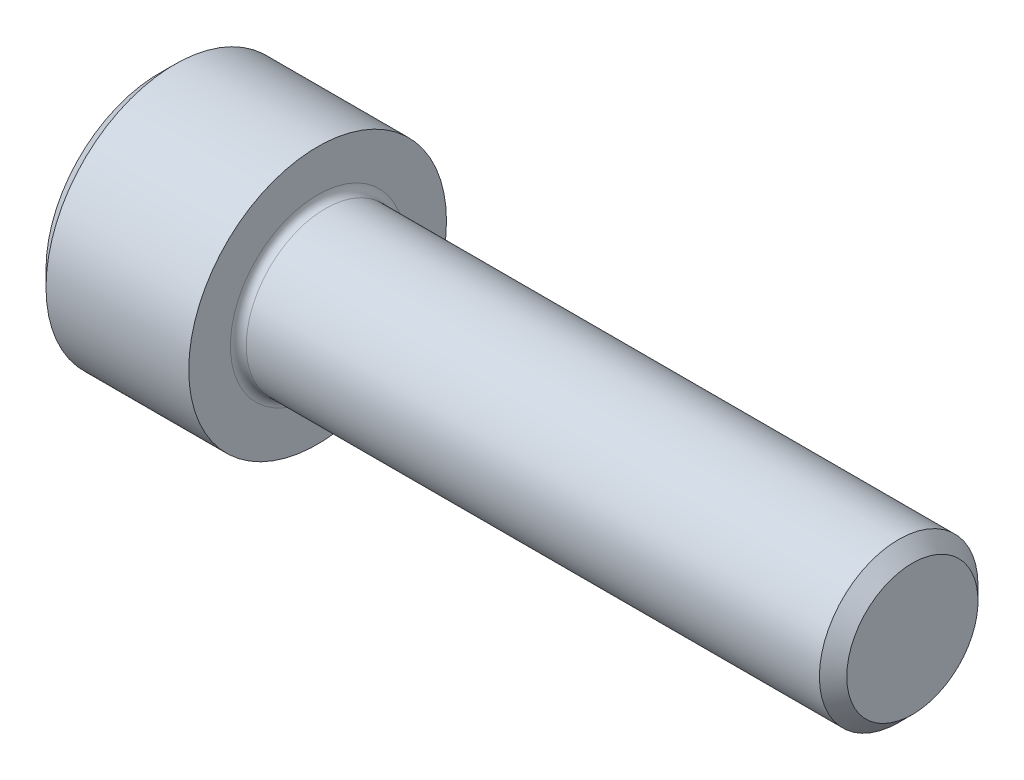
ISO-10303-21;
HEADER;
FILE_DESCRIPTION(('STEP AP214'),'2;1');
FILE_NAME('part.step','',(''),(''),'','','');
FILE_SCHEMA(('AUTOMOTIVE_DESIGN { 1 0 10303 214 1 1 1 1 }'));
ENDSEC;
DATA;
#1=APPLICATION_CONTEXT('core data for automotive mechanical design processes');
#2=APPLICATION_PROTOCOL_DEFINITION('international standard','automotive_design',2000,#1);
#3=PRODUCT_CONTEXT('',#1,'mechanical');
#4=PRODUCT('Part','Part','',(#3));
#5=PRODUCT_RELATED_PRODUCT_CATEGORY('part','',(#4));
#6=PRODUCT_DEFINITION_FORMATION('','',#4);
#7=PRODUCT_DEFINITION_CONTEXT('part definition',#1,'design');
#8=PRODUCT_DEFINITION('design','',#6,#7);
#9=PRODUCT_DEFINITION_SHAPE('','',#8);
#10=(LENGTH_UNIT() NAMED_UNIT(*) SI_UNIT(.MILLI.,.METRE.));
#11=(NAMED_UNIT(*) PLANE_ANGLE_UNIT() SI_UNIT($,.RADIAN.));
#12=(NAMED_UNIT(*) SI_UNIT($,.STERADIAN.) SOLID_ANGLE_UNIT());
#13=UNCERTAINTY_MEASURE_WITH_UNIT(LENGTH_MEASURE(1.E-05),#10,'distance_accuracy_value','');
#14=(GEOMETRIC_REPRESENTATION_CONTEXT(3) GLOBAL_UNCERTAINTY_ASSIGNED_CONTEXT((#13)) GLOBAL_UNIT_ASSIGNED_CONTEXT((#10,
#11,#12)) REPRESENTATION_CONTEXT('',''));
#15=CARTESIAN_POINT('',(0.,0.,0.));
#16=DIRECTION('',(0.,0.,1.));
#17=DIRECTION('',(1.,0.,0.));
#18=AXIS2_PLACEMENT_3D('',#15,#16,#17);
#19=CARTESIAN_POINT('',(38.,-3.349214,3.349214));
#20=DIRECTION('',(1.,0.,0.));
#21=DIRECTION('',(0.,0.,-1.));
#22=AXIS2_PLACEMENT_3D('',#19,#20,#21);
#23=PLANE('',#22);
#24=CARTESIAN_POINT('',(38.,0.,0.));
#25=DIRECTION('',(-1.,0.,0.));
#26=DIRECTION('',(0.,0.,1.));
#27=AXIS2_PLACEMENT_3D('',#24,#25,#26);
#28=CIRCLE('',#27,3.30949999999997);
#29=CARTESIAN_POINT('',(38.,0.,3.30949999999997));
#30=VERTEX_POINT('',#29);
#31=EDGE_CURVE('E20',#30,#30,#28,.F.);
#32=ORIENTED_EDGE('',*,*,#31,.T.);
#33=EDGE_LOOP('',(#32));
#34=FACE_BOUND('',#33,.T.);
#35=ADVANCED_FACE('F16',(#34),#23,.T.);
#36=CARTESIAN_POINT('',(38.,0.,0.));
#37=DIRECTION('',(-1.,0.,0.));
#38=DIRECTION('',(0.,0.,1.));
#39=AXIS2_PLACEMENT_3D('',#36,#37,#38);
#40=CONICAL_SURFACE('',#39,3.3095,0.785398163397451);
#41=CARTESIAN_POINT('',(37.3095,0.,0.));
#42=DIRECTION('',(-1.,0.,0.));
#43=DIRECTION('',(0.,0.,1.));
#44=AXIS2_PLACEMENT_3D('',#41,#42,#43);
#45=CIRCLE('',#44,4.);
#46=CARTESIAN_POINT('',(37.3095,0.,4.));
#47=VERTEX_POINT('',#46);
#48=EDGE_CURVE('E124',#47,#47,#45,.F.);
#49=ORIENTED_EDGE('',*,*,#48,.T.);
#50=EDGE_LOOP('',(#49));
#51=FACE_BOUND('',#50,.T.);
#52=ORIENTED_EDGE('',*,*,#31,.F.);
#53=EDGE_LOOP('',(#52));
#54=FACE_BOUND('',#53,.T.);
#55=ADVANCED_FACE('F254',(#51,#54),#40,.T.);
#56=CARTESIAN_POINT('',(37.3095,0.,0.));
#57=DIRECTION('',(-1.,0.,0.));
#58=DIRECTION('',(0.,-1.,0.));
#59=AXIS2_PLACEMENT_3D('',#56,#57,#58);
#60=CYLINDRICAL_SURFACE('',#59,4.);
#61=CARTESIAN_POINT('',(8.40000000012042,0.,0.));
#62=DIRECTION('',(1.,0.,0.));
#63=DIRECTION('',(0.,0.,-1.));
#64=AXIS2_PLACEMENT_3D('',#61,#62,#63);
#65=CIRCLE('',#64,4.00000000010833);
#66=CARTESIAN_POINT('',(8.40000000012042,0.,-4.00000000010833));
#67=VERTEX_POINT('',#66);
#68=EDGE_CURVE('E120',#67,#67,#65,.T.);
#69=ORIENTED_EDGE('',*,*,#68,.T.);
#70=EDGE_LOOP('',(#69));
#71=FACE_BOUND('',#70,.T.);
#72=ORIENTED_EDGE('',*,*,#48,.F.);
#73=EDGE_LOOP('',(#72));
#74=FACE_BOUND('',#73,.T.);
#75=ADVANCED_FACE('F250',(#71,#74),#60,.T.);
#76=CARTESIAN_POINT('',(8.40000000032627,0.,0.));
#77=DIRECTION('',(1.,0.,0.));
#78=DIRECTION('',(0.,0.,-1.));
#79=AXIS2_PLACEMENT_3D('',#76,#77,#78);
#80=TOROIDAL_SURFACE('',#79,4.40000000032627,0.400000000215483);
#81=ORIENTED_EDGE('',*,*,#68,.F.);
#82=EDGE_LOOP('',(#81));
#83=FACE_BOUND('',#82,.T.);
#84=CARTESIAN_POINT('',(8.00000000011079,0.,0.));
#85=DIRECTION('',(1.,0.,0.));
#86=DIRECTION('',(0.,0.,-1.));
#87=AXIS2_PLACEMENT_3D('',#84,#85,#86);
#88=CIRCLE('',#87,4.400000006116);
#89=CARTESIAN_POINT('',(8.00000000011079,0.,-4.400000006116));
#90=VERTEX_POINT('',#89);
#91=EDGE_CURVE('E118',#90,#90,#88,.F.);
#92=ORIENTED_EDGE('',*,*,#91,.F.);
#93=EDGE_LOOP('',(#92));
#94=FACE_BOUND('',#93,.T.);
#95=ADVANCED_FACE('F253',(#83,#94),#80,.F.);
#96=CARTESIAN_POINT('',(8.,-6.578,6.578));
#97=DIRECTION('',(1.,0.,0.));
#98=DIRECTION('',(0.,0.,-1.));
#99=AXIS2_PLACEMENT_3D('',#96,#97,#98);
#100=PLANE('',#99);
#101=ORIENTED_EDGE('',*,*,#91,.T.);
#102=EDGE_LOOP('',(#101));
#103=FACE_BOUND('',#102,.T.);
#104=CARTESIAN_POINT('',(8.,0.,0.));
#105=DIRECTION('',(-1.,0.,0.));
#106=DIRECTION('',(0.,0.,1.));
#107=AXIS2_PLACEMENT_3D('',#104,#105,#106);
#108=CIRCLE('',#107,6.5);
#109=CARTESIAN_POINT('',(8.,0.,6.5));
#110=VERTEX_POINT('',#109);
#111=EDGE_CURVE('E116',#110,#110,#108,.F.);
#112=ORIENTED_EDGE('',*,*,#111,.T.);
#113=EDGE_LOOP('',(#112));
#114=FACE_BOUND('',#113,.T.);
#115=ADVANCED_FACE('F248',(#103,#114),#100,.T.);
#116=CARTESIAN_POINT('',(8.,0.,0.));
#117=DIRECTION('',(-1.,0.,0.));
#118=DIRECTION('',(0.,0.,1.));
#119=AXIS2_PLACEMENT_3D('',#116,#117,#118);
#120=CYLINDRICAL_SURFACE('',#119,6.5);
#121=CARTESIAN_POINT('',(0.799999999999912,0.,0.));
#122=DIRECTION('',(1.,0.,0.));
#123=DIRECTION('',(0.,0.,-1.));
#124=AXIS2_PLACEMENT_3D('',#121,#122,#123);
#125=CIRCLE('',#124,6.5);
#126=CARTESIAN_POINT('',(0.8,0.,-6.5));
#127=VERTEX_POINT('',#126);
#128=EDGE_CURVE('E93',#127,#127,#125,.T.);
#129=ORIENTED_EDGE('',*,*,#128,.T.);
#130=EDGE_LOOP('',(#129));
#131=FACE_BOUND('',#130,.T.);
#132=ORIENTED_EDGE('',*,*,#111,.F.);
#133=EDGE_LOOP('',(#132));
#134=FACE_BOUND('',#133,.T.);
#135=ADVANCED_FACE('F244',(#131,#134),#120,.T.);
#136=CARTESIAN_POINT('',(0.,0.,0.));
#137=DIRECTION('',(1.,0.,0.));
#138=DIRECTION('',(0.,0.,-1.));
#139=AXIS2_PLACEMENT_3D('',#136,#137,#138);
#140=CONICAL_SURFACE('',#139,5.7,0.785398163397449);
#141=ORIENTED_EDGE('',*,*,#128,.F.);
#142=EDGE_LOOP('',(#141));
#143=FACE_BOUND('',#142,.T.);
#144=CARTESIAN_POINT('',(0.,0.,0.));
#145=DIRECTION('',(1.,0.,0.));
#146=DIRECTION('',(0.,0.,-1.));
#147=AXIS2_PLACEMENT_3D('',#144,#145,#146);
#148=CIRCLE('',#147,5.7);
#149=CARTESIAN_POINT('',(0.,0.,-5.7));
#150=VERTEX_POINT('',#149);
#151=EDGE_CURVE('E92',#150,#150,#148,.F.);
#152=ORIENTED_EDGE('',*,*,#151,.F.);
#153=EDGE_LOOP('',(#152));
#154=FACE_BOUND('',#153,.T.);
#155=ADVANCED_FACE('F241',(#143,#154),#140,.T.);
#156=CARTESIAN_POINT('',(0.,1.759474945,-3.0475));
#157=DIRECTION('',(0.,0.866025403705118,-0.500000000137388));
#158=DIRECTION('',(0.,0.500000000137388,0.866025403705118));
#159=AXIS2_PLACEMENT_3D('',#156,#157,#158);
#160=PLANE('',#159);
#161=DIRECTION('',(1.,0.,0.));
#162=VECTOR('',#161,1.);
#163=CARTESIAN_POINT('',(2.,1.759474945,-3.0475));
#164=LINE('',#163,#162);
#165=CARTESIAN_POINT('',(0.,1.75947494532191,-3.0475));
#166=VERTEX_POINT('',#165);
#167=CARTESIAN_POINT('',(4.,1.759474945,-3.0475));
#168=VERTEX_POINT('',#167);
#169=EDGE_CURVE('E159',#166,#168,#164,.T.);
#170=ORIENTED_EDGE('',*,*,#169,.T.);
#171=DIRECTION('',(0.,0.500000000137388,0.866025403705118));
#172=VECTOR('',#171,1.);
#173=CARTESIAN_POINT('',(4.,1.759474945,-3.0475));
#174=LINE('',#173,#172);
#175=CARTESIAN_POINT('',(4.,2.63921241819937,-1.52374999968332));
#176=VERTEX_POINT('',#175);
#177=EDGE_CURVE('E157',#168,#176,#174,.T.);
#178=ORIENTED_EDGE('',*,*,#177,.T.);
#179=DIRECTION('',(0.,0.500000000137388,0.866025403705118));
#180=VECTOR('',#179,1.);
#181=CARTESIAN_POINT('',(4.,1.759474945,-3.0475));
#182=LINE('',#181,#180);
#183=CARTESIAN_POINT('',(4.,3.518949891,0.));
#184=VERTEX_POINT('',#183);
#185=EDGE_CURVE('E87',#176,#184,#182,.T.);
#186=ORIENTED_EDGE('',*,*,#185,.T.);
#187=DIRECTION('',(1.,0.,0.));
#188=VECTOR('',#187,1.);
#189=CARTESIAN_POINT('',(2.,3.518949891,0.));
#190=LINE('',#189,#188);
#191=CARTESIAN_POINT('',(0.,3.5189498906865,-4.93629063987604E-11));
#192=VERTEX_POINT('',#191);
#193=EDGE_CURVE('E80',#192,#184,#190,.T.);
#194=ORIENTED_EDGE('',*,*,#193,.F.);
#195=DIRECTION('',(0.,0.499999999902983,0.866025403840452));
#196=VECTOR('',#195,1.);
#197=CARTESIAN_POINT('',(0.,1.759474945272,-3.047500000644));
#198=LINE('',#197,#196);
#199=EDGE_CURVE('E84',#166,#192,#198,.T.);
#200=ORIENTED_EDGE('',*,*,#199,.F.);
#201=EDGE_LOOP('',(#170,#178,#186,#194,#200));
#202=FACE_BOUND('',#201,.T.);
#203=ADVANCED_FACE('F83',(#202),#160,.F.);
#204=CARTESIAN_POINT('',(0.,1.759474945,3.0475));
#205=DIRECTION('',(0.,-0.866025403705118,-0.500000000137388));
#206=DIRECTION('',(0.,0.500000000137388,-0.866025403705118));
#207=AXIS2_PLACEMENT_3D('',#204,#205,#206);
#208=PLANE('',#207);
#209=DIRECTION('',(0.,0.500000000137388,-0.866025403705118));
#210=VECTOR('',#209,1.);
#211=CARTESIAN_POINT('',(4.,1.759474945,3.0475));
#212=LINE('',#211,#210);
#213=CARTESIAN_POINT('',(4.,2.63921241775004,1.52375000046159));
#214=VERTEX_POINT('',#213);
#215=CARTESIAN_POINT('',(4.,1.759474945,3.0475));
#216=VERTEX_POINT('',#215);
#217=EDGE_CURVE('E105',#214,#216,#212,.F.);
#218=ORIENTED_EDGE('',*,*,#217,.T.);
#219=DIRECTION('',(-1.,0.,0.));
#220=VECTOR('',#219,1.);
#221=CARTESIAN_POINT('',(2.,1.759474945,3.0475));
#222=LINE('',#221,#220);
#223=CARTESIAN_POINT('',(0.,1.75947494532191,3.0475));
#224=VERTEX_POINT('',#223);
#225=EDGE_CURVE('E110',#216,#224,#222,.T.);
#226=ORIENTED_EDGE('',*,*,#225,.T.);
#227=DIRECTION('',(0.,-0.499999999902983,0.866025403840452));
#228=VECTOR('',#227,1.);
#229=CARTESIAN_POINT('',(0.,3.518949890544,0.));
#230=LINE('',#229,#228);
#231=EDGE_CURVE('E100',#192,#224,#230,.T.);
#232=ORIENTED_EDGE('',*,*,#231,.F.);
#233=ORIENTED_EDGE('',*,*,#193,.T.);
#234=DIRECTION('',(0.,0.500000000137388,-0.866025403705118));
#235=VECTOR('',#234,1.);
#236=CARTESIAN_POINT('',(4.,1.759474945,3.0475));
#237=LINE('',#236,#235);
#238=EDGE_CURVE('E160',#184,#214,#237,.F.);
#239=ORIENTED_EDGE('',*,*,#238,.T.);
#240=EDGE_LOOP('',(#218,#226,#232,#233,#239));
#241=FACE_BOUND('',#240,.T.);
#242=ADVANCED_FACE('F108',(#241),#208,.T.);
#243=CARTESIAN_POINT('',(0.,-5.7684,-5.7684));
#244=DIRECTION('',(-1.,0.,0.));
#245=DIRECTION('',(0.,0.,1.));
#246=AXIS2_PLACEMENT_3D('',#243,#244,#245);
#247=PLANE('',#246);
#248=DIRECTION('',(0.,1.,0.));
#249=VECTOR('',#248,1.);
#250=CARTESIAN_POINT('',(0.,0.,-3.0475));
#251=LINE('',#250,#249);
#252=CARTESIAN_POINT('',(0.,-1.759474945,-3.0475));
#253=VERTEX_POINT('',#252);
#254=EDGE_CURVE('E104',#253,#166,#251,.T.);
#255=ORIENTED_EDGE('',*,*,#254,.T.);
#256=ORIENTED_EDGE('',*,*,#199,.T.);
#257=ORIENTED_EDGE('',*,*,#231,.T.);
#258=DIRECTION('',(0.,-1.,0.));
#259=VECTOR('',#258,1.);
#260=CARTESIAN_POINT('',(0.,0.,3.0475));
#261=LINE('',#260,#259);
#262=CARTESIAN_POINT('',(0.,-1.759474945,3.0475));
#263=VERTEX_POINT('',#262);
#264=EDGE_CURVE('E172',#224,#263,#261,.T.);
#265=ORIENTED_EDGE('',*,*,#264,.T.);
#266=DIRECTION('',(0.,0.500000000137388,0.866025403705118));
#267=VECTOR('',#266,1.);
#268=CARTESIAN_POINT('',(0.,-2.639212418,1.52375));
#269=LINE('',#268,#267);
#270=CARTESIAN_POINT('',(0.,-3.518949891,0.));
#271=VERTEX_POINT('',#270);
#272=EDGE_CURVE('E198',#271,#263,#269,.T.);
#273=ORIENTED_EDGE('',*,*,#272,.F.);
#274=DIRECTION('',(0.,-0.500000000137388,0.866025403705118));
#275=VECTOR('',#274,1.);
#276=CARTESIAN_POINT('',(0.,-2.639212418,-1.52375));
#277=LINE('',#276,#275);
#278=EDGE_CURVE('E178',#253,#271,#277,.T.);
#279=ORIENTED_EDGE('',*,*,#278,.F.);
#280=EDGE_LOOP('',(#255,#256,#257,#265,#273,#279));
#281=FACE_BOUND('',#280,.T.);
#282=ORIENTED_EDGE('',*,*,#151,.T.);
#283=EDGE_LOOP('',(#282));
#284=FACE_BOUND('',#283,.T.);
#285=ADVANCED_FACE('F97',(#281,#284),#247,.T.);
#286=CARTESIAN_POINT('',(4.,-0.015835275,3.0475));
#287=DIRECTION('',(1.,0.,0.));
#288=DIRECTION('',(0.,0.,-1.));
#289=AXIS2_PLACEMENT_3D('',#286,#287,#288);
#290=PLANE('',#289);
#291=ORIENTED_EDGE('',*,*,#217,.F.);
#292=CARTESIAN_POINT('',(4.,0.,0.));
#293=DIRECTION('',(-1.,0.,0.));
#294=DIRECTION('',(0.,0.,1.));
#295=AXIS2_PLACEMENT_3D('',#292,#293,#294);
#296=CIRCLE('',#295,3.0475);
#297=CARTESIAN_POINT('',(4.,-2.73646157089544E-10,3.0475));
#298=VERTEX_POINT('',#297);
#299=EDGE_CURVE('E153',#298,#214,#296,.T.);
#300=ORIENTED_EDGE('',*,*,#299,.F.);
#301=DIRECTION('',(0.,1.,0.));
#302=VECTOR('',#301,1.);
#303=CARTESIAN_POINT('',(4.,0.,3.0475));
#304=LINE('',#303,#302);
#305=EDGE_CURVE('E169',#298,#216,#304,.T.);
#306=ORIENTED_EDGE('',*,*,#305,.T.);
#307=EDGE_LOOP('',(#291,#300,#306));
#308=FACE_BOUND('',#307,.T.);
#309=ADVANCED_FACE('F174',(#308),#290,.F.);
#310=CARTESIAN_POINT('',(4.,2.633933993,1.542035));
#311=DIRECTION('',(1.,0.,0.));
#312=DIRECTION('',(0.,0.,-1.));
#313=AXIS2_PLACEMENT_3D('',#310,#311,#312);
#314=PLANE('',#313);
#315=ORIENTED_EDGE('',*,*,#185,.F.);
#316=CARTESIAN_POINT('',(4.,0.,0.));
#317=DIRECTION('',(-1.,0.,0.));
#318=DIRECTION('',(0.,0.,1.));
#319=AXIS2_PLACEMENT_3D('',#316,#317,#318);
#320=CIRCLE('',#319,3.0475);
#321=EDGE_CURVE('E150',#214,#176,#320,.T.);
#322=ORIENTED_EDGE('',*,*,#321,.F.);
#323=ORIENTED_EDGE('',*,*,#238,.F.);
#324=EDGE_LOOP('',(#315,#322,#323));
#325=FACE_BOUND('',#324,.T.);
#326=ADVANCED_FACE('F221',(#325),#314,.F.);
#327=CARTESIAN_POINT('',(4.,-0.015835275,-1.5146075));
#328=DIRECTION('',(1.,0.,0.));
#329=DIRECTION('',(0.,0.,-1.));
#330=AXIS2_PLACEMENT_3D('',#327,#328,#329);
#331=PLANE('',#330);
#332=DIRECTION('',(0.,-1.,0.));
#333=VECTOR('',#332,1.);
#334=CARTESIAN_POINT('',(4.,0.,-3.0475));
#335=LINE('',#334,#333);
#336=CARTESIAN_POINT('',(4.,-6.2505282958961E-10,-3.0475));
#337=VERTEX_POINT('',#336);
#338=EDGE_CURVE('E189',#168,#337,#335,.T.);
#339=ORIENTED_EDGE('',*,*,#338,.T.);
#340=CARTESIAN_POINT('',(4.,0.,0.));
#341=DIRECTION('',(-1.,0.,0.));
#342=DIRECTION('',(0.,0.,1.));
#343=AXIS2_PLACEMENT_3D('',#340,#341,#342);
#344=CIRCLE('',#343,3.0475);
#345=EDGE_CURVE('E148',#176,#337,#344,.T.);
#346=ORIENTED_EDGE('',*,*,#345,.F.);
#347=ORIENTED_EDGE('',*,*,#177,.F.);
#348=EDGE_LOOP('',(#339,#346,#347));
#349=FACE_BOUND('',#348,.T.);
#350=ADVANCED_FACE('F217',(#349),#331,.F.);
#351=CARTESIAN_POINT('',(0.,-1.759474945,-3.0475));
#352=DIRECTION('',(0.,0.,-1.));
#353=DIRECTION('',(0.,1.,0.));
#354=AXIS2_PLACEMENT_3D('',#351,#352,#353);
#355=PLANE('',#354);
#356=DIRECTION('',(-1.,0.,0.));
#357=VECTOR('',#356,1.);
#358=CARTESIAN_POINT('',(2.,-1.759474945,-3.0475));
#359=LINE('',#358,#357);
#360=CARTESIAN_POINT('',(4.,-1.759474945,-3.0475));
#361=VERTEX_POINT('',#360);
#362=EDGE_CURVE('E175',#361,#253,#359,.T.);
#363=ORIENTED_EDGE('',*,*,#362,.F.);
#364=DIRECTION('',(0.,1.,0.));
#365=VECTOR('',#364,1.);
#366=CARTESIAN_POINT('',(4.,-1.319606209,-3.0475));
#367=LINE('',#366,#365);
#368=EDGE_CURVE('E144',#361,#337,#367,.T.);
#369=ORIENTED_EDGE('',*,*,#368,.T.);
#370=ORIENTED_EDGE('',*,*,#338,.F.);
#371=ORIENTED_EDGE('',*,*,#169,.F.);
#372=ORIENTED_EDGE('',*,*,#254,.F.);
#373=EDGE_LOOP('',(#363,#369,#370,#371,#372));
#374=FACE_BOUND('',#373,.T.);
#375=ADVANCED_FACE('F212',(#374),#355,.F.);
#376=CARTESIAN_POINT('',(0.,-1.759474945,-3.0475));
#377=DIRECTION('',(0.,0.866025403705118,0.500000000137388));
#378=DIRECTION('',(0.,-0.500000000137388,0.866025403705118));
#379=AXIS2_PLACEMENT_3D('',#376,#377,#378);
#380=PLANE('',#379);
#381=DIRECTION('',(0.,-0.500000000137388,0.866025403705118));
#382=VECTOR('',#381,1.);
#383=CARTESIAN_POINT('',(4.,-1.759474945,-3.0475));
#384=LINE('',#383,#382);
#385=CARTESIAN_POINT('',(4.,-2.63921241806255,-1.5237499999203));
#386=VERTEX_POINT('',#385);
#387=EDGE_CURVE('E145',#386,#361,#384,.F.);
#388=ORIENTED_EDGE('',*,*,#387,.T.);
#389=ORIENTED_EDGE('',*,*,#362,.T.);
#390=ORIENTED_EDGE('',*,*,#278,.T.);
#391=DIRECTION('',(-1.,0.,0.));
#392=VECTOR('',#391,1.);
#393=CARTESIAN_POINT('',(2.,-3.518949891,0.));
#394=LINE('',#393,#392);
#395=CARTESIAN_POINT('',(4.,-3.518949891,0.));
#396=VERTEX_POINT('',#395);
#397=EDGE_CURVE('E156',#396,#271,#394,.T.);
#398=ORIENTED_EDGE('',*,*,#397,.F.);
#399=DIRECTION('',(0.,-0.500000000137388,0.866025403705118));
#400=VECTOR('',#399,1.);
#401=CARTESIAN_POINT('',(4.,-1.759474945,-3.0475));
#402=LINE('',#401,#400);
#403=EDGE_CURVE('E140',#396,#386,#402,.F.);
#404=ORIENTED_EDGE('',*,*,#403,.T.);
#405=EDGE_LOOP('',(#388,#389,#390,#398,#404));
#406=FACE_BOUND('',#405,.T.);
#407=ADVANCED_FACE('F297',(#406),#380,.T.);
#408=CARTESIAN_POINT('',(0.,1.759474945,3.0475));
#409=DIRECTION('',(0.,0.,1.));
#410=DIRECTION('',(0.,-1.,0.));
#411=AXIS2_PLACEMENT_3D('',#408,#409,#410);
#412=PLANE('',#411);
#413=ORIENTED_EDGE('',*,*,#225,.F.);
#414=ORIENTED_EDGE('',*,*,#305,.F.);
#415=DIRECTION('',(0.,-1.,0.));
#416=VECTOR('',#415,1.);
#417=CARTESIAN_POINT('',(4.,-1.319606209,3.0475));
#418=LINE('',#417,#416);
#419=CARTESIAN_POINT('',(4.,-1.759474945,3.0475));
#420=VERTEX_POINT('',#419);
#421=EDGE_CURVE('E139',#298,#420,#418,.T.);
#422=ORIENTED_EDGE('',*,*,#421,.T.);
#423=DIRECTION('',(1.,0.,0.));
#424=VECTOR('',#423,1.);
#425=CARTESIAN_POINT('',(2.,-1.759474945,3.0475));
#426=LINE('',#425,#424);
#427=EDGE_CURVE('E186',#263,#420,#426,.T.);
#428=ORIENTED_EDGE('',*,*,#427,.F.);
#429=ORIENTED_EDGE('',*,*,#264,.F.);
#430=EDGE_LOOP('',(#413,#414,#422,#428,#429));
#431=FACE_BOUND('',#430,.T.);
#432=ADVANCED_FACE('F167',(#431),#412,.F.);
#433=CARTESIAN_POINT('',(0.,-3.518949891,0.));
#434=DIRECTION('',(0.,0.866025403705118,-0.500000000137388));
#435=DIRECTION('',(0.,0.500000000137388,0.866025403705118));
#436=AXIS2_PLACEMENT_3D('',#433,#434,#435);
#437=PLANE('',#436);
#438=DIRECTION('',(0.,0.500000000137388,0.866025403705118));
#439=VECTOR('',#438,1.);
#440=CARTESIAN_POINT('',(4.,-3.518949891,0.));
#441=LINE('',#440,#439);
#442=CARTESIAN_POINT('',(4.,-2.63921241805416,1.52374999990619));
#443=VERTEX_POINT('',#442);
#444=EDGE_CURVE('E35',#443,#396,#441,.F.);
#445=ORIENTED_EDGE('',*,*,#444,.T.);
#446=ORIENTED_EDGE('',*,*,#397,.T.);
#447=ORIENTED_EDGE('',*,*,#272,.T.);
#448=ORIENTED_EDGE('',*,*,#427,.T.);
#449=DIRECTION('',(0.,0.500000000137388,0.866025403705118));
#450=VECTOR('',#449,1.);
#451=CARTESIAN_POINT('',(4.,-3.518949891,0.));
#452=LINE('',#451,#450);
#453=EDGE_CURVE('E136',#420,#443,#452,.F.);
#454=ORIENTED_EDGE('',*,*,#453,.T.);
#455=EDGE_LOOP('',(#445,#446,#447,#448,#454));
#456=FACE_BOUND('',#455,.T.);
#457=ADVANCED_FACE('F311',(#456),#437,.T.);
#458=CARTESIAN_POINT('',(4.,-2.655047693,-1.5146075));
#459=DIRECTION('',(1.,0.,0.));
#460=DIRECTION('',(0.,0.,-1.));
#461=AXIS2_PLACEMENT_3D('',#458,#459,#460);
#462=PLANE('',#461);
#463=ORIENTED_EDGE('',*,*,#387,.F.);
#464=CARTESIAN_POINT('',(4.,0.,0.));
#465=DIRECTION('',(-1.,0.,0.));
#466=DIRECTION('',(0.,0.,1.));
#467=AXIS2_PLACEMENT_3D('',#464,#465,#466);
#468=CIRCLE('',#467,3.0475);
#469=EDGE_CURVE('E133',#337,#386,#468,.T.);
#470=ORIENTED_EDGE('',*,*,#469,.F.);
#471=ORIENTED_EDGE('',*,*,#368,.F.);
#472=EDGE_LOOP('',(#463,#470,#471));
#473=FACE_BOUND('',#472,.T.);
#474=ADVANCED_FACE('F318',(#473),#462,.F.);
#475=CARTESIAN_POINT('',(4.,-3.524228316,1.542035));
#476=DIRECTION('',(1.,0.,0.));
#477=DIRECTION('',(0.,0.,-1.));
#478=AXIS2_PLACEMENT_3D('',#475,#476,#477);
#479=PLANE('',#478);
#480=ORIENTED_EDGE('',*,*,#444,.F.);
#481=CARTESIAN_POINT('',(4.,0.,0.));
#482=DIRECTION('',(-1.,0.,0.));
#483=DIRECTION('',(0.,0.,1.));
#484=AXIS2_PLACEMENT_3D('',#481,#482,#483);
#485=CIRCLE('',#484,3.0475);
#486=EDGE_CURVE('E26',#386,#443,#485,.T.);
#487=ORIENTED_EDGE('',*,*,#486,.F.);
#488=ORIENTED_EDGE('',*,*,#403,.F.);
#489=EDGE_LOOP('',(#480,#487,#488));
#490=FACE_BOUND('',#489,.T.);
#491=ADVANCED_FACE('F237',(#490),#479,.F.);
#492=CARTESIAN_POINT('',(4.,-2.655047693,3.0475));
#493=DIRECTION('',(1.,0.,0.));
#494=DIRECTION('',(0.,0.,-1.));
#495=AXIS2_PLACEMENT_3D('',#492,#493,#494);
#496=PLANE('',#495);
#497=ORIENTED_EDGE('',*,*,#421,.F.);
#498=CARTESIAN_POINT('',(4.,0.,0.));
#499=DIRECTION('',(-1.,0.,0.));
#500=DIRECTION('',(0.,0.,1.));
#501=AXIS2_PLACEMENT_3D('',#498,#499,#500);
#502=CIRCLE('',#501,3.0475);
#503=EDGE_CURVE('E10',#443,#298,#502,.T.);
#504=ORIENTED_EDGE('',*,*,#503,.F.);
#505=ORIENTED_EDGE('',*,*,#453,.F.);
#506=EDGE_LOOP('',(#497,#504,#505));
#507=FACE_BOUND('',#506,.T.);
#508=ADVANCED_FACE('F18',(#507),#496,.F.);
#509=CARTESIAN_POINT('',(5.759474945,0.,0.));
#510=DIRECTION('',(-1.,0.,0.));
#511=DIRECTION('',(0.,0.,1.));
#512=AXIS2_PLACEMENT_3D('',#509,#510,#511);
#513=CONICAL_SURFACE('',#512,0.,1.04719755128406);
#514=CARTESIAN_POINT('',(5.759474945,0.,0.));
#515=VERTEX_POINT('',#514);
#516=VERTEX_LOOP('',#515);
#517=FACE_BOUND('',#516,.T.);
#518=ORIENTED_EDGE('',*,*,#486,.T.);
#519=ORIENTED_EDGE('',*,*,#503,.T.);
#520=ORIENTED_EDGE('',*,*,#299,.T.);
#521=ORIENTED_EDGE('',*,*,#321,.T.);
#522=ORIENTED_EDGE('',*,*,#345,.T.);
#523=ORIENTED_EDGE('',*,*,#469,.T.);
#524=EDGE_LOOP('',(#518,#519,#520,#521,#522,#523));
#525=FACE_BOUND('',#524,.T.);
#526=ADVANCED_FACE('F219',(#517,#525),#513,.F.);
#527=CLOSED_SHELL('',(#35,#55,#75,#95,#115,#135,#155,#203,#242,#285,#309,#326,#350,#375,#407,
#432,#457,#474,#491,#508,#526));
#528=MANIFOLD_SOLID_BREP('B1',#527);
#529=ADVANCED_BREP_SHAPE_REPRESENTATION('',(#18,#528),#14);
#530=SHAPE_DEFINITION_REPRESENTATION(#9,#529);
ENDSEC;
END-ISO-10303-21;
